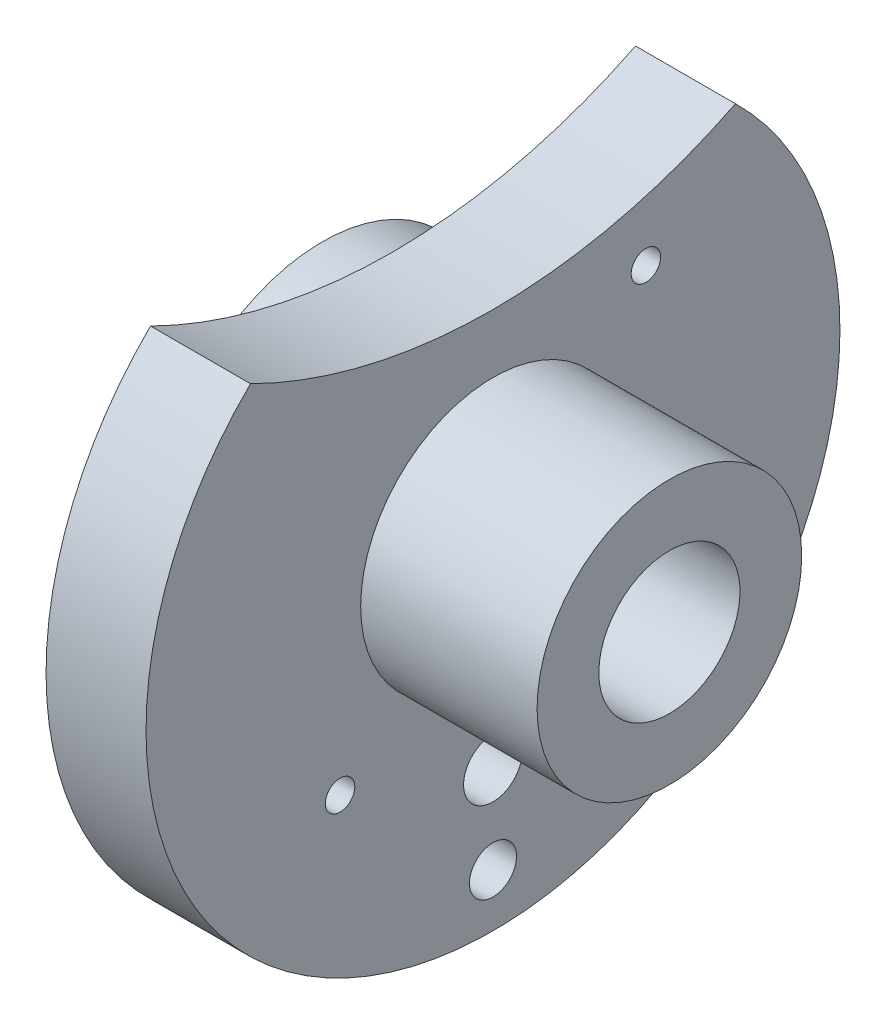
from build123d import *

# Parameters (mm, degrees)
ESQUISSE2_R             = 92.5
ENL_V_MAT_EXTRU_1_DEPTH = 96.765338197
ESQUISSE6_R             = 5
ESQUISSE6_R_2           = 4
ENL_V_MAT_EXTRU_2_DEPTH = 96.765338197
ESQUISSE7_R             = 2.5
ENL_V_MAT_EXTRU_3_DEPTH = 96.765338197


with BuildPart() as part:
    # Esquisse1 → Base-R_volution (revolve)
    with BuildSketch(Plane.XY, mode=Mode.PRIVATE) as base_r_volution_sk:
        Polygon((0, 24), (0, 28), (12, 28), (12, 59), (29, 59), (29, 22.5), (59, 22.5), (59, 12), (19, 12), (19, 24), align=None)
    revolve(base_r_volution_sk.sketch.rotate(Axis((-50, 0, 0), (1, 0, 0)), 90), axis=Axis((-50, 0, 0), (1, 0, 0)))

    # Esquisse2 → Enl_v. mat.-Extru.1 (cut, through all)
    with BuildSketch(Plane.ZY.offset(-12)):
        with Locations((0, 125)):
            Circle(ESQUISSE2_R)
    extrude(amount=-ENL_V_MAT_EXTRU_1_DEPTH, mode=Mode.SUBTRACT)

    # Esquisse6 → Enl_v. mat.-Extru.2 (cut, through all)
    with BuildSketch(Plane.ZY.offset(-12)):
        with Locations((0, -35)):
            Circle(ESQUISSE6_R)
        with Locations((0, -50)):
            Circle(ESQUISSE6_R_2)
    extrude(amount=-ENL_V_MAT_EXTRU_2_DEPTH, mode=Mode.SUBTRACT)

    # Esquisse7 → Enl_v. mat.-Extru.3 (cut, through all)
    with BuildSketch(Plane.ZY.offset(-12)):
        with Locations((-26, 26)):
            Circle(ESQUISSE7_R)
        with Locations((26, -26)):
            Circle(ESQUISSE7_R)
    extrude(amount=-ENL_V_MAT_EXTRU_3_DEPTH, mode=Mode.SUBTRACT)


solid = part.part
